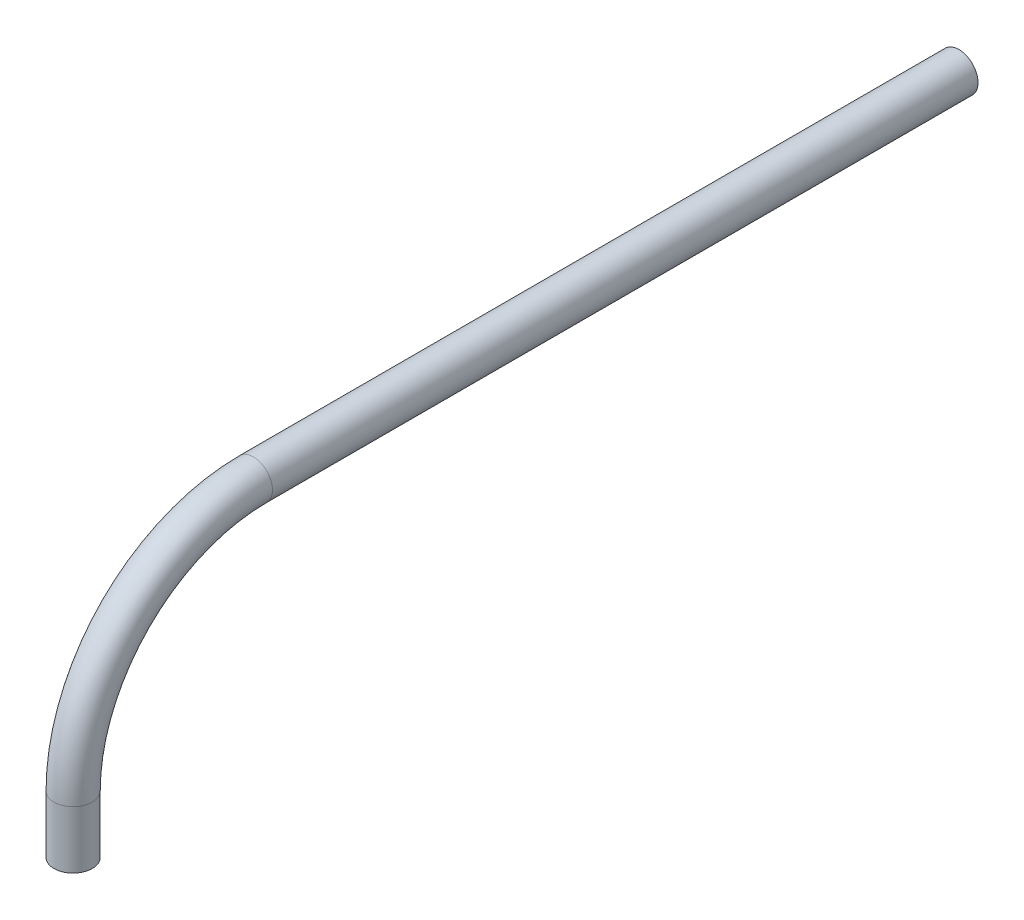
ISO-10303-21;
HEADER;
FILE_DESCRIPTION(('STEP AP214'),'2;1');
FILE_NAME('part.step','',(''),(''),'','','');
FILE_SCHEMA(('AUTOMOTIVE_DESIGN { 1 0 10303 214 1 1 1 1 }'));
ENDSEC;
DATA;
#1=APPLICATION_CONTEXT('core data for automotive mechanical design processes');
#2=APPLICATION_PROTOCOL_DEFINITION('international standard','automotive_design',2000,#1);
#3=PRODUCT_CONTEXT('',#1,'mechanical');
#4=PRODUCT('Part','Part','',(#3));
#5=PRODUCT_RELATED_PRODUCT_CATEGORY('part','',(#4));
#6=PRODUCT_DEFINITION_FORMATION('','',#4);
#7=PRODUCT_DEFINITION_CONTEXT('part definition',#1,'design');
#8=PRODUCT_DEFINITION('design','',#6,#7);
#9=PRODUCT_DEFINITION_SHAPE('','',#8);
#10=(LENGTH_UNIT() NAMED_UNIT(*) SI_UNIT(.MILLI.,.METRE.));
#11=(NAMED_UNIT(*) PLANE_ANGLE_UNIT() SI_UNIT($,.RADIAN.));
#12=(NAMED_UNIT(*) SI_UNIT($,.STERADIAN.) SOLID_ANGLE_UNIT());
#13=UNCERTAINTY_MEASURE_WITH_UNIT(LENGTH_MEASURE(1.E-05),#10,'distance_accuracy_value','');
#14=(GEOMETRIC_REPRESENTATION_CONTEXT(3) GLOBAL_UNCERTAINTY_ASSIGNED_CONTEXT((#13)) GLOBAL_UNIT_ASSIGNED_CONTEXT((#10,
#11,#12)) REPRESENTATION_CONTEXT('',''));
#15=CARTESIAN_POINT('',(0.,0.,0.));
#16=DIRECTION('',(0.,0.,1.));
#17=DIRECTION('',(1.,0.,0.));
#18=AXIS2_PLACEMENT_3D('',#15,#16,#17);
#19=CARTESIAN_POINT('',(0.,-74.6125,366.7125));
#20=DIRECTION('',(0.,-1.,0.));
#21=DIRECTION('',(0.,0.,-1.));
#22=AXIS2_PLACEMENT_3D('',#19,#20,#21);
#23=CYLINDRICAL_SURFACE('',#22,7.9375);
#24=CARTESIAN_POINT('',(0.,-74.6125,366.7125));
#25=DIRECTION('',(0.,-1.,0.));
#26=DIRECTION('',(1.,0.,0.));
#27=AXIS2_PLACEMENT_3D('',#24,#25,#26);
#28=CIRCLE('',#27,7.9375);
#29=CARTESIAN_POINT('',(0.,-74.6125,374.65));
#30=VERTEX_POINT('',#29);
#31=EDGE_CURVE('E54',#30,#30,#28,.T.);
#32=ORIENTED_EDGE('',*,*,#31,.T.);
#33=EDGE_LOOP('',(#32));
#34=FACE_BOUND('',#33,.T.);
#35=CARTESIAN_POINT('',(0.,-98.4250000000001,366.7125));
#36=DIRECTION('',(0.,-1.,0.));
#37=DIRECTION('',(1.,0.,0.));
#38=AXIS2_PLACEMENT_3D('',#35,#36,#37);
#39=CIRCLE('',#38,7.9375);
#40=CARTESIAN_POINT('',(7.9375,-98.4250000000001,366.7125));
#41=VERTEX_POINT('',#40);
#42=EDGE_CURVE('E45',#41,#41,#39,.T.);
#43=ORIENTED_EDGE('',*,*,#42,.F.);
#44=EDGE_LOOP('',(#43));
#45=FACE_BOUND('',#44,.T.);
#46=ADVANCED_FACE('F34',(#34,#45),#23,.T.);
#47=CARTESIAN_POINT('',(0.,-74.6125,366.7125));
#48=DIRECTION('',(0.,-1.,0.));
#49=DIRECTION('',(0.,0.,-1.));
#50=AXIS2_PLACEMENT_3D('',#47,#48,#49);
#51=CYLINDRICAL_SURFACE('',#50,6.2865);
#52=CARTESIAN_POINT('',(0.,-74.6125,366.7125));
#53=DIRECTION('',(0.,-1.,0.));
#54=DIRECTION('',(1.,0.,0.));
#55=AXIS2_PLACEMENT_3D('',#52,#53,#54);
#56=CIRCLE('',#55,6.2865);
#57=CARTESIAN_POINT('',(0.,-74.6125,372.999));
#58=VERTEX_POINT('',#57);
#59=EDGE_CURVE('E57',#58,#58,#56,.T.);
#60=ORIENTED_EDGE('',*,*,#59,.F.);
#61=EDGE_LOOP('',(#60));
#62=FACE_BOUND('',#61,.T.);
#63=CARTESIAN_POINT('',(0.,-98.4250000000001,366.7125));
#64=DIRECTION('',(0.,-1.,0.));
#65=DIRECTION('',(1.,0.,0.));
#66=AXIS2_PLACEMENT_3D('',#63,#64,#65);
#67=CIRCLE('',#66,6.2865);
#68=CARTESIAN_POINT('',(6.2865,-98.4250000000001,366.7125));
#69=VERTEX_POINT('',#68);
#70=EDGE_CURVE('E49',#69,#69,#67,.T.);
#71=ORIENTED_EDGE('',*,*,#70,.T.);
#72=EDGE_LOOP('',(#71));
#73=FACE_BOUND('',#72,.T.);
#74=ADVANCED_FACE('F79',(#62,#73),#51,.F.);
#75=CARTESIAN_POINT('',(0.,-74.6125000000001,292.1));
#76=DIRECTION('',(1.,0.,0.));
#77=DIRECTION('',(0.,0.,-1.));
#78=AXIS2_PLACEMENT_3D('',#75,#76,#77);
#79=TOROIDAL_SURFACE('',#78,74.6125,7.9375);
#80=CARTESIAN_POINT('',(0.,0.,292.1));
#81=DIRECTION('',(0.,0.,1.));
#82=DIRECTION('',(1.,0.,0.));
#83=AXIS2_PLACEMENT_3D('',#80,#81,#82);
#84=CIRCLE('',#83,7.9375);
#85=CARTESIAN_POINT('',(0.,7.93749999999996,292.1));
#86=VERTEX_POINT('',#85);
#87=EDGE_CURVE('E60',#86,#86,#84,.T.);
#88=CARTESIAN_POINT('',(0.,-74.6125000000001,292.1));
#89=DIRECTION('',(1.,0.,0.));
#90=DIRECTION('',(0.,0.,-1.));
#91=AXIS2_PLACEMENT_3D('',#88,#89,#90);
#92=CIRCLE('',#91,82.55);
#93=EDGE_CURVE('',#86,#30,#92,.T.);
#94=ORIENTED_EDGE('',*,*,#87,.T.);
#95=ORIENTED_EDGE('',*,*,#31,.F.);
#96=ORIENTED_EDGE('',*,*,#93,.T.);
#97=ORIENTED_EDGE('',*,*,#93,.F.);
#98=EDGE_LOOP('',(#94,#96,#95,#97));
#99=FACE_BOUND('',#98,.T.);
#100=ADVANCED_FACE('F75',(#99),#79,.T.);
#101=CARTESIAN_POINT('',(0.,-74.6125000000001,292.1));
#102=DIRECTION('',(1.,0.,0.));
#103=DIRECTION('',(0.,0.,-1.));
#104=AXIS2_PLACEMENT_3D('',#101,#102,#103);
#105=TOROIDAL_SURFACE('',#104,74.6125,6.2865);
#106=CARTESIAN_POINT('',(0.,0.,292.1));
#107=DIRECTION('',(0.,0.,1.));
#108=DIRECTION('',(1.,0.,0.));
#109=AXIS2_PLACEMENT_3D('',#106,#107,#108);
#110=CIRCLE('',#109,6.2865);
#111=CARTESIAN_POINT('',(0.,6.28649999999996,292.1));
#112=VERTEX_POINT('',#111);
#113=EDGE_CURVE('E64',#112,#112,#110,.T.);
#114=CARTESIAN_POINT('',(0.,-74.6125000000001,292.1));
#115=DIRECTION('',(1.,0.,0.));
#116=DIRECTION('',(0.,0.,-1.));
#117=AXIS2_PLACEMENT_3D('',#114,#115,#116);
#118=CIRCLE('',#117,80.899);
#119=EDGE_CURVE('',#112,#58,#118,.T.);
#120=ORIENTED_EDGE('',*,*,#113,.F.);
#121=ORIENTED_EDGE('',*,*,#59,.T.);
#122=ORIENTED_EDGE('',*,*,#119,.T.);
#123=ORIENTED_EDGE('',*,*,#119,.F.);
#124=EDGE_LOOP('',(#120,#122,#121,#123));
#125=FACE_BOUND('',#124,.T.);
#126=ADVANCED_FACE('F72',(#125),#105,.F.);
#127=CARTESIAN_POINT('',(0.,0.,292.1));
#128=DIRECTION('',(0.,0.,-1.));
#129=DIRECTION('',(0.,1.,0.));
#130=AXIS2_PLACEMENT_3D('',#127,#128,#129);
#131=CYLINDRICAL_SURFACE('',#130,6.2865);
#132=CARTESIAN_POINT('',(0.,0.,0.508000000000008));
#133=DIRECTION('',(0.,0.,1.));
#134=DIRECTION('',(0.,-1.,0.));
#135=AXIS2_PLACEMENT_3D('',#132,#133,#134);
#136=CIRCLE('',#135,6.2865);
#137=CARTESIAN_POINT('',(0.,-6.2865,0.508000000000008));
#138=VERTEX_POINT('',#137);
#139=EDGE_CURVE('E10',#138,#138,#136,.F.);
#140=ORIENTED_EDGE('',*,*,#139,.T.);
#141=EDGE_LOOP('',(#140));
#142=FACE_BOUND('',#141,.T.);
#143=ORIENTED_EDGE('',*,*,#113,.T.);
#144=EDGE_LOOP('',(#143));
#145=FACE_BOUND('',#144,.T.);
#146=ADVANCED_FACE('F70',(#142,#145),#131,.F.);
#147=CARTESIAN_POINT('',(0.,0.,292.1));
#148=DIRECTION('',(0.,0.,-1.));
#149=DIRECTION('',(0.,1.,0.));
#150=AXIS2_PLACEMENT_3D('',#147,#148,#149);
#151=CYLINDRICAL_SURFACE('',#150,7.9375);
#152=ORIENTED_EDGE('',*,*,#87,.F.);
#153=EDGE_LOOP('',(#152));
#154=FACE_BOUND('',#153,.T.);
#155=CARTESIAN_POINT('',(0.,0.,0.));
#156=DIRECTION('',(0.,0.,1.));
#157=DIRECTION('',(1.,0.,0.));
#158=AXIS2_PLACEMENT_3D('',#155,#156,#157);
#159=CIRCLE('',#158,7.9375);
#160=CARTESIAN_POINT('',(7.9375,0.,0.));
#161=VERTEX_POINT('',#160);
#162=EDGE_CURVE('E61',#161,#161,#159,.T.);
#163=ORIENTED_EDGE('',*,*,#162,.T.);
#164=EDGE_LOOP('',(#163));
#165=FACE_BOUND('',#164,.T.);
#166=ADVANCED_FACE('F89',(#154,#165),#151,.T.);
#167=CARTESIAN_POINT('',(0.,-98.4250000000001,366.7125));
#168=DIRECTION('',(0.,-1.,0.));
#169=DIRECTION('',(1.,0.,0.));
#170=AXIS2_PLACEMENT_3D('',#167,#168,#169);
#171=PLANE('',#170);
#172=ORIENTED_EDGE('',*,*,#70,.F.);
#173=EDGE_LOOP('',(#172));
#174=FACE_BOUND('',#173,.T.);
#175=ORIENTED_EDGE('',*,*,#42,.T.);
#176=EDGE_LOOP('',(#175));
#177=FACE_BOUND('',#176,.T.);
#178=ADVANCED_FACE('F85',(#174,#177),#171,.T.);
#179=CARTESIAN_POINT('',(0.,0.,0.));
#180=DIRECTION('',(0.,0.,1.));
#181=DIRECTION('',(1.,0.,0.));
#182=AXIS2_PLACEMENT_3D('',#179,#180,#181);
#183=PLANE('',#182);
#184=CARTESIAN_POINT('',(0.,0.,0.));
#185=DIRECTION('',(0.,0.,1.));
#186=DIRECTION('',(1.,0.,0.));
#187=AXIS2_PLACEMENT_3D('',#184,#185,#186);
#188=CIRCLE('',#187,6.79450000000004);
#189=CARTESIAN_POINT('',(6.79450000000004,0.,0.));
#190=VERTEX_POINT('',#189);
#191=EDGE_CURVE('E41',#190,#190,#188,.T.);
#192=ORIENTED_EDGE('',*,*,#191,.T.);
#193=EDGE_LOOP('',(#192));
#194=FACE_BOUND('',#193,.T.);
#195=ORIENTED_EDGE('',*,*,#162,.F.);
#196=EDGE_LOOP('',(#195));
#197=FACE_BOUND('',#196,.T.);
#198=ADVANCED_FACE('F88',(#194,#197),#183,.F.);
#199=CARTESIAN_POINT('',(0.,0.,0.));
#200=DIRECTION('',(0.,0.,-1.));
#201=DIRECTION('',(0.,1.,0.));
#202=AXIS2_PLACEMENT_3D('',#199,#200,#201);
#203=CONICAL_SURFACE('',#202,6.79450000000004,0.785398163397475);
#204=ORIENTED_EDGE('',*,*,#139,.F.);
#205=EDGE_LOOP('',(#204));
#206=FACE_BOUND('',#205,.T.);
#207=ORIENTED_EDGE('',*,*,#191,.F.);
#208=EDGE_LOOP('',(#207));
#209=FACE_BOUND('',#208,.T.);
#210=ADVANCED_FACE('F36',(#206,#209),#203,.F.);
#211=CLOSED_SHELL('',(#46,#74,#100,#126,#146,#166,#178,#198,#210));
#212=MANIFOLD_SOLID_BREP('B2',#211);
#213=ADVANCED_BREP_SHAPE_REPRESENTATION('',(#18,#212),#14);
#214=SHAPE_DEFINITION_REPRESENTATION(#9,#213);
ENDSEC;
END-ISO-10303-21;
